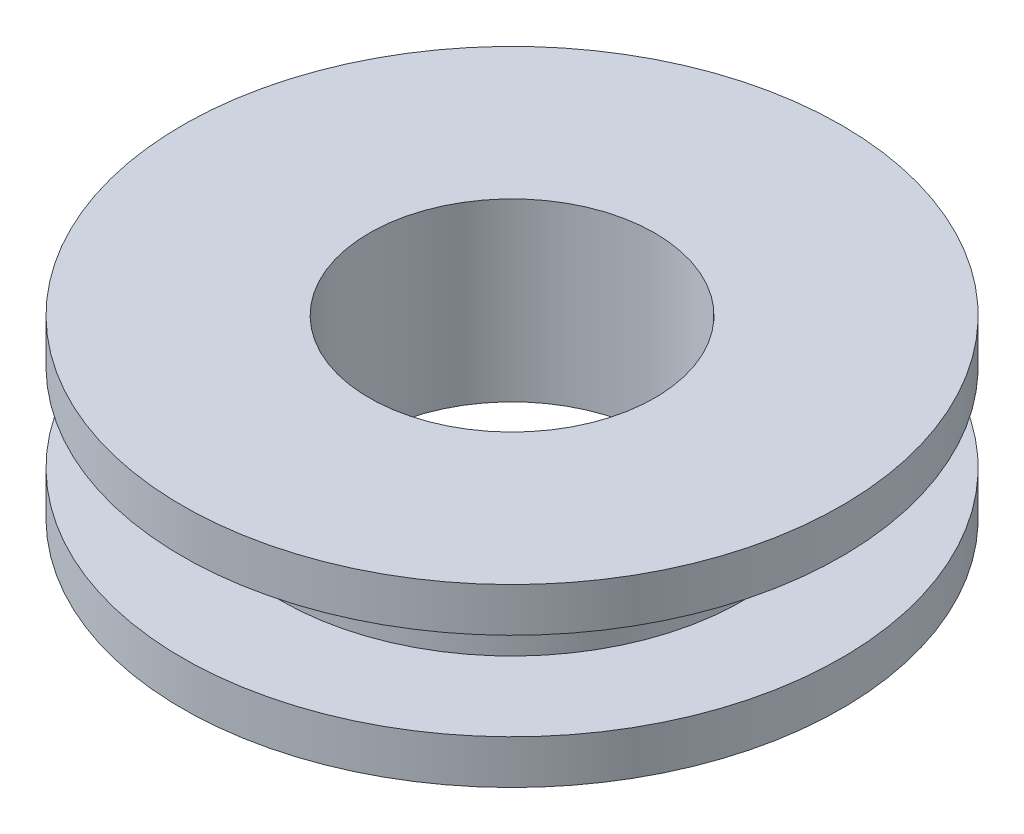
ISO-10303-21;
HEADER;
FILE_DESCRIPTION(('STEP AP214'),'2;1');
FILE_NAME('part.step','',(''),(''),'','','');
FILE_SCHEMA(('AUTOMOTIVE_DESIGN { 1 0 10303 214 1 1 1 1 }'));
ENDSEC;
DATA;
#1=APPLICATION_CONTEXT('core data for automotive mechanical design processes');
#2=APPLICATION_PROTOCOL_DEFINITION('international standard','automotive_design',2000,#1);
#3=PRODUCT_CONTEXT('',#1,'mechanical');
#4=PRODUCT('Part','Part','',(#3));
#5=PRODUCT_RELATED_PRODUCT_CATEGORY('part','',(#4));
#6=PRODUCT_DEFINITION_FORMATION('','',#4);
#7=PRODUCT_DEFINITION_CONTEXT('part definition',#1,'design');
#8=PRODUCT_DEFINITION('design','',#6,#7);
#9=PRODUCT_DEFINITION_SHAPE('','',#8);
#10=(LENGTH_UNIT() NAMED_UNIT(*) SI_UNIT(.MILLI.,.METRE.));
#11=(NAMED_UNIT(*) PLANE_ANGLE_UNIT() SI_UNIT($,.RADIAN.));
#12=(NAMED_UNIT(*) SI_UNIT($,.STERADIAN.) SOLID_ANGLE_UNIT());
#13=UNCERTAINTY_MEASURE_WITH_UNIT(LENGTH_MEASURE(1.E-05),#10,'distance_accuracy_value','');
#14=(GEOMETRIC_REPRESENTATION_CONTEXT(3) GLOBAL_UNCERTAINTY_ASSIGNED_CONTEXT((#13)) GLOBAL_UNIT_ASSIGNED_CONTEXT((#10,
#11,#12)) REPRESENTATION_CONTEXT('',''));
#15=CARTESIAN_POINT('',(0.,0.,0.));
#16=DIRECTION('',(0.,0.,1.));
#17=DIRECTION('',(1.,0.,0.));
#18=AXIS2_PLACEMENT_3D('',#15,#16,#17);
#19=CARTESIAN_POINT('',(0.,10.,-52.5));
#20=DIRECTION('',(0.,-1.,0.));
#21=DIRECTION('',(0.,0.,-1.));
#22=AXIS2_PLACEMENT_3D('',#19,#20,#21);
#23=PLANE('',#22);
#24=CARTESIAN_POINT('',(0.,9.99999999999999,0.));
#25=DIRECTION('',(0.,-1.,0.));
#26=DIRECTION('',(0.,0.,-1.));
#27=AXIS2_PLACEMENT_3D('',#24,#25,#26);
#28=CIRCLE('',#27,75.);
#29=CARTESIAN_POINT('',(0.,9.99999999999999,-75.));
#30=VERTEX_POINT('',#29);
#31=EDGE_CURVE('E10',#30,#30,#28,.T.);
#32=ORIENTED_EDGE('',*,*,#31,.T.);
#33=EDGE_LOOP('',(#32));
#34=FACE_BOUND('',#33,.T.);
#35=CARTESIAN_POINT('',(0.,9.99999999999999,0.));
#36=DIRECTION('',(0.,-1.,0.));
#37=DIRECTION('',(0.,0.,-1.));
#38=AXIS2_PLACEMENT_3D('',#35,#36,#37);
#39=CIRCLE('',#38,52.5);
#40=CARTESIAN_POINT('',(0.,9.99999999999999,-52.5));
#41=VERTEX_POINT('',#40);
#42=EDGE_CURVE('E63',#41,#41,#39,.T.);
#43=ORIENTED_EDGE('',*,*,#42,.F.);
#44=EDGE_LOOP('',(#43));
#45=FACE_BOUND('',#44,.T.);
#46=ADVANCED_FACE('F35',(#34,#45),#23,.T.);
#47=CARTESIAN_POINT('',(0.,-66.3062283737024,0.));
#48=DIRECTION('',(0.,-1.,0.));
#49=DIRECTION('',(0.,0.,-1.));
#50=AXIS2_PLACEMENT_3D('',#47,#48,#49);
#51=CYLINDRICAL_SURFACE('',#50,75.);
#52=CARTESIAN_POINT('',(0.,20.,0.));
#53=DIRECTION('',(0.,-1.,0.));
#54=DIRECTION('',(0.,0.,-1.));
#55=AXIS2_PLACEMENT_3D('',#52,#53,#54);
#56=CIRCLE('',#55,75.);
#57=CARTESIAN_POINT('',(0.,20.,-75.));
#58=VERTEX_POINT('',#57);
#59=EDGE_CURVE('E41',#58,#58,#56,.T.);
#60=ORIENTED_EDGE('',*,*,#59,.T.);
#61=EDGE_LOOP('',(#60));
#62=FACE_BOUND('',#61,.T.);
#63=ORIENTED_EDGE('',*,*,#31,.F.);
#64=EDGE_LOOP('',(#63));
#65=FACE_BOUND('',#64,.T.);
#66=ADVANCED_FACE('F71',(#62,#65),#51,.T.);
#67=CARTESIAN_POINT('',(0.,20.,-75.));
#68=DIRECTION('',(0.,1.,0.));
#69=DIRECTION('',(0.,0.,1.));
#70=AXIS2_PLACEMENT_3D('',#67,#68,#69);
#71=PLANE('',#70);
#72=CARTESIAN_POINT('',(0.,20.,0.));
#73=DIRECTION('',(0.,-1.,0.));
#74=DIRECTION('',(0.,0.,-1.));
#75=AXIS2_PLACEMENT_3D('',#72,#73,#74);
#76=CIRCLE('',#75,32.5);
#77=CARTESIAN_POINT('',(0.,20.,-32.5));
#78=VERTEX_POINT('',#77);
#79=EDGE_CURVE('E45',#78,#78,#76,.T.);
#80=ORIENTED_EDGE('',*,*,#79,.T.);
#81=EDGE_LOOP('',(#80));
#82=FACE_BOUND('',#81,.T.);
#83=ORIENTED_EDGE('',*,*,#59,.F.);
#84=EDGE_LOOP('',(#83));
#85=FACE_BOUND('',#84,.T.);
#86=ADVANCED_FACE('F75',(#82,#85),#71,.T.);
#87=CARTESIAN_POINT('',(0.,-66.3062283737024,0.));
#88=DIRECTION('',(0.,-1.,0.));
#89=DIRECTION('',(0.,0.,-1.));
#90=AXIS2_PLACEMENT_3D('',#87,#88,#89);
#91=CYLINDRICAL_SURFACE('',#90,32.5);
#92=CARTESIAN_POINT('',(0.,-20.,0.));
#93=DIRECTION('',(0.,-1.,0.));
#94=DIRECTION('',(0.,0.,-1.));
#95=AXIS2_PLACEMENT_3D('',#92,#93,#94);
#96=CIRCLE('',#95,32.5);
#97=CARTESIAN_POINT('',(0.,-20.,-32.5));
#98=VERTEX_POINT('',#97);
#99=EDGE_CURVE('E49',#98,#98,#96,.T.);
#100=ORIENTED_EDGE('',*,*,#99,.T.);
#101=EDGE_LOOP('',(#100));
#102=FACE_BOUND('',#101,.T.);
#103=ORIENTED_EDGE('',*,*,#79,.F.);
#104=EDGE_LOOP('',(#103));
#105=FACE_BOUND('',#104,.T.);
#106=ADVANCED_FACE('F79',(#102,#105),#91,.F.);
#107=CARTESIAN_POINT('',(0.,-20.,-32.5));
#108=DIRECTION('',(0.,-1.,0.));
#109=DIRECTION('',(0.,0.,-1.));
#110=AXIS2_PLACEMENT_3D('',#107,#108,#109);
#111=PLANE('',#110);
#112=CARTESIAN_POINT('',(0.,-20.,0.));
#113=DIRECTION('',(0.,-1.,0.));
#114=DIRECTION('',(0.,0.,-1.));
#115=AXIS2_PLACEMENT_3D('',#112,#113,#114);
#116=CIRCLE('',#115,75.);
#117=CARTESIAN_POINT('',(0.,-20.,-75.));
#118=VERTEX_POINT('',#117);
#119=EDGE_CURVE('E54',#118,#118,#116,.T.);
#120=ORIENTED_EDGE('',*,*,#119,.T.);
#121=EDGE_LOOP('',(#120));
#122=FACE_BOUND('',#121,.T.);
#123=ORIENTED_EDGE('',*,*,#99,.F.);
#124=EDGE_LOOP('',(#123));
#125=FACE_BOUND('',#124,.T.);
#126=ADVANCED_FACE('F86',(#122,#125),#111,.T.);
#127=CARTESIAN_POINT('',(0.,-66.3062283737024,0.));
#128=DIRECTION('',(0.,-1.,0.));
#129=DIRECTION('',(0.,0.,-1.));
#130=AXIS2_PLACEMENT_3D('',#127,#128,#129);
#131=CYLINDRICAL_SURFACE('',#130,75.);
#132=CARTESIAN_POINT('',(0.,-10.,0.));
#133=DIRECTION('',(0.,-1.,0.));
#134=DIRECTION('',(0.,0.,-1.));
#135=AXIS2_PLACEMENT_3D('',#132,#133,#134);
#136=CIRCLE('',#135,75.);
#137=CARTESIAN_POINT('',(0.,-10.,-75.));
#138=VERTEX_POINT('',#137);
#139=EDGE_CURVE('E57',#138,#138,#136,.T.);
#140=ORIENTED_EDGE('',*,*,#139,.T.);
#141=EDGE_LOOP('',(#140));
#142=FACE_BOUND('',#141,.T.);
#143=ORIENTED_EDGE('',*,*,#119,.F.);
#144=EDGE_LOOP('',(#143));
#145=FACE_BOUND('',#144,.T.);
#146=ADVANCED_FACE('F90',(#142,#145),#131,.T.);
#147=CARTESIAN_POINT('',(0.,-10.,-75.));
#148=DIRECTION('',(0.,1.,0.));
#149=DIRECTION('',(0.,0.,1.));
#150=AXIS2_PLACEMENT_3D('',#147,#148,#149);
#151=PLANE('',#150);
#152=CARTESIAN_POINT('',(0.,-10.,0.));
#153=DIRECTION('',(0.,-1.,0.));
#154=DIRECTION('',(0.,0.,-1.));
#155=AXIS2_PLACEMENT_3D('',#152,#153,#154);
#156=CIRCLE('',#155,52.5);
#157=CARTESIAN_POINT('',(0.,-10.,-52.5));
#158=VERTEX_POINT('',#157);
#159=EDGE_CURVE('E60',#158,#158,#156,.T.);
#160=ORIENTED_EDGE('',*,*,#159,.T.);
#161=EDGE_LOOP('',(#160));
#162=FACE_BOUND('',#161,.T.);
#163=ORIENTED_EDGE('',*,*,#139,.F.);
#164=EDGE_LOOP('',(#163));
#165=FACE_BOUND('',#164,.T.);
#166=ADVANCED_FACE('F94',(#162,#165),#151,.T.);
#167=CARTESIAN_POINT('',(0.,-66.3062283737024,0.));
#168=DIRECTION('',(0.,-1.,0.));
#169=DIRECTION('',(0.,0.,-1.));
#170=AXIS2_PLACEMENT_3D('',#167,#168,#169);
#171=CYLINDRICAL_SURFACE('',#170,52.5);
#172=ORIENTED_EDGE('',*,*,#42,.T.);
#173=EDGE_LOOP('',(#172));
#174=FACE_BOUND('',#173,.T.);
#175=ORIENTED_EDGE('',*,*,#159,.F.);
#176=EDGE_LOOP('',(#175));
#177=FACE_BOUND('',#176,.T.);
#178=ADVANCED_FACE('F67',(#174,#177),#171,.T.);
#179=CLOSED_SHELL('',(#46,#66,#86,#106,#126,#146,#166,#178));
#180=MANIFOLD_SOLID_BREP('B2',#179);
#181=ADVANCED_BREP_SHAPE_REPRESENTATION('',(#18,#180),#14);
#182=SHAPE_DEFINITION_REPRESENTATION(#9,#181);
ENDSEC;
END-ISO-10303-21;
